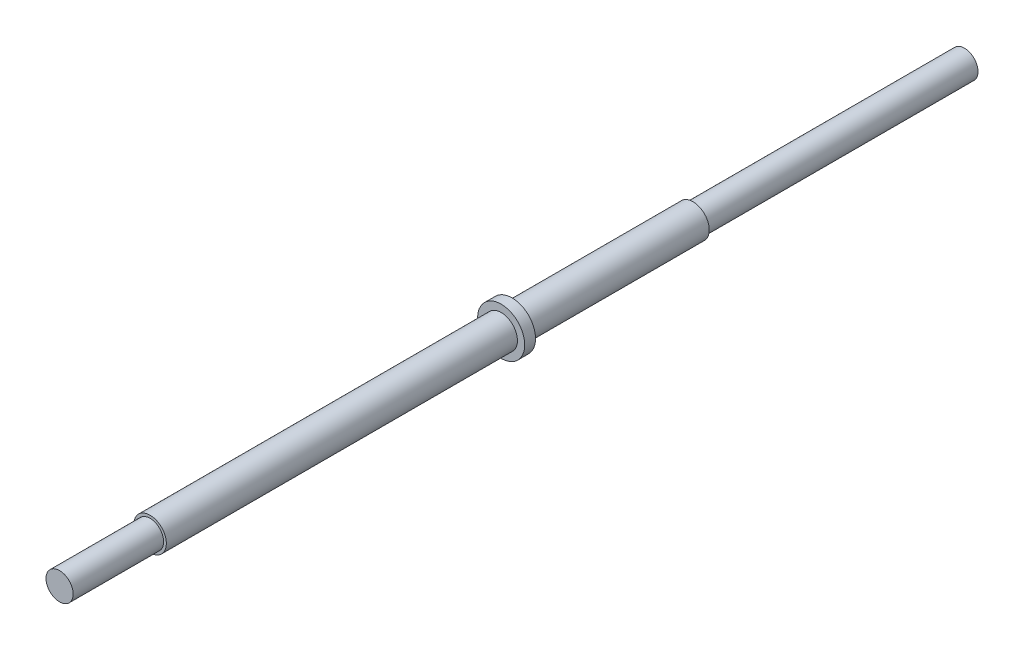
ISO-10303-21;
HEADER;
FILE_DESCRIPTION(('STEP AP214'),'2;1');
FILE_NAME('part.step','',(''),(''),'','','');
FILE_SCHEMA(('AUTOMOTIVE_DESIGN { 1 0 10303 214 1 1 1 1 }'));
ENDSEC;
DATA;
#1=APPLICATION_CONTEXT('core data for automotive mechanical design processes');
#2=APPLICATION_PROTOCOL_DEFINITION('international standard','automotive_design',2000,#1);
#3=PRODUCT_CONTEXT('',#1,'mechanical');
#4=PRODUCT('Part','Part','',(#3));
#5=PRODUCT_RELATED_PRODUCT_CATEGORY('part','',(#4));
#6=PRODUCT_DEFINITION_FORMATION('','',#4);
#7=PRODUCT_DEFINITION_CONTEXT('part definition',#1,'design');
#8=PRODUCT_DEFINITION('design','',#6,#7);
#9=PRODUCT_DEFINITION_SHAPE('','',#8);
#10=(LENGTH_UNIT() NAMED_UNIT(*) SI_UNIT(.MILLI.,.METRE.));
#11=(NAMED_UNIT(*) PLANE_ANGLE_UNIT() SI_UNIT($,.RADIAN.));
#12=(NAMED_UNIT(*) SI_UNIT($,.STERADIAN.) SOLID_ANGLE_UNIT());
#13=UNCERTAINTY_MEASURE_WITH_UNIT(LENGTH_MEASURE(1.E-05),#10,'distance_accuracy_value','');
#14=(GEOMETRIC_REPRESENTATION_CONTEXT(3) GLOBAL_UNCERTAINTY_ASSIGNED_CONTEXT((#13)) GLOBAL_UNIT_ASSIGNED_CONTEXT((#10,
#11,#12)) REPRESENTATION_CONTEXT('',''));
#15=CARTESIAN_POINT('',(0.,0.,0.));
#16=DIRECTION('',(0.,0.,1.));
#17=DIRECTION('',(1.,0.,0.));
#18=AXIS2_PLACEMENT_3D('',#15,#16,#17);
#19=CARTESIAN_POINT('',(0.,0.,0.));
#20=DIRECTION('',(0.,0.,-1.));
#21=DIRECTION('',(-1.,0.,0.));
#22=AXIS2_PLACEMENT_3D('',#19,#20,#21);
#23=CYLINDRICAL_SURFACE('',#22,4.50048818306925);
#24=CARTESIAN_POINT('',(0.,0.,125.));
#25=DIRECTION('',(0.,0.,-1.));
#26=DIRECTION('',(-1.,0.,0.));
#27=AXIS2_PLACEMENT_3D('',#24,#25,#26);
#28=CIRCLE('',#27,4.50048818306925);
#29=CARTESIAN_POINT('',(-4.50048818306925,0.,125.));
#30=VERTEX_POINT('',#29);
#31=EDGE_CURVE('E11',#30,#30,#28,.T.);
#32=ORIENTED_EDGE('',*,*,#31,.T.);
#33=EDGE_LOOP('',(#32));
#34=FACE_BOUND('',#33,.T.);
#35=CARTESIAN_POINT('',(0.,0.,128.));
#36=DIRECTION('',(0.,0.,-1.));
#37=DIRECTION('',(-1.,0.,0.));
#38=AXIS2_PLACEMENT_3D('',#35,#36,#37);
#39=CIRCLE('',#38,4.50048818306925);
#40=CARTESIAN_POINT('',(-4.50048818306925,0.,128.));
#41=VERTEX_POINT('',#40);
#42=EDGE_CURVE('E61',#41,#41,#39,.T.);
#43=ORIENTED_EDGE('',*,*,#42,.F.);
#44=EDGE_LOOP('',(#43));
#45=FACE_BOUND('',#44,.T.);
#46=ADVANCED_FACE('F47',(#34,#45),#23,.F.);
#47=CARTESIAN_POINT('',(0.,4.50048818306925,125.));
#48=DIRECTION('',(0.,0.,-1.));
#49=DIRECTION('',(-1.,0.,0.));
#50=AXIS2_PLACEMENT_3D('',#47,#48,#49);
#51=PLANE('',#50);
#52=CARTESIAN_POINT('',(0.,0.,125.));
#53=DIRECTION('',(0.,0.,-1.));
#54=DIRECTION('',(-1.,0.,0.));
#55=AXIS2_PLACEMENT_3D('',#52,#53,#54);
#56=CIRCLE('',#55,6.50048818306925);
#57=CARTESIAN_POINT('',(-6.50048818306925,0.,125.));
#58=VERTEX_POINT('',#57);
#59=EDGE_CURVE('E53',#58,#58,#56,.T.);
#60=ORIENTED_EDGE('',*,*,#59,.T.);
#61=EDGE_LOOP('',(#60));
#62=FACE_BOUND('',#61,.T.);
#63=ORIENTED_EDGE('',*,*,#31,.F.);
#64=EDGE_LOOP('',(#63));
#65=FACE_BOUND('',#64,.T.);
#66=ADVANCED_FACE('F71',(#62,#65),#51,.T.);
#67=CARTESIAN_POINT('',(0.,0.,0.));
#68=DIRECTION('',(0.,0.,-1.));
#69=DIRECTION('',(-1.,0.,0.));
#70=AXIS2_PLACEMENT_3D('',#67,#68,#69);
#71=CYLINDRICAL_SURFACE('',#70,6.50048818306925);
#72=CARTESIAN_POINT('',(0.,0.,128.));
#73=DIRECTION('',(0.,0.,-1.));
#74=DIRECTION('',(-1.,0.,0.));
#75=AXIS2_PLACEMENT_3D('',#72,#73,#74);
#76=CIRCLE('',#75,6.50048818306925);
#77=CARTESIAN_POINT('',(-6.50048818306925,0.,128.));
#78=VERTEX_POINT('',#77);
#79=EDGE_CURVE('E57',#78,#78,#76,.T.);
#80=ORIENTED_EDGE('',*,*,#79,.T.);
#81=EDGE_LOOP('',(#80));
#82=FACE_BOUND('',#81,.T.);
#83=ORIENTED_EDGE('',*,*,#59,.F.);
#84=EDGE_LOOP('',(#83));
#85=FACE_BOUND('',#84,.T.);
#86=ADVANCED_FACE('F75',(#82,#85),#71,.T.);
#87=CARTESIAN_POINT('',(0.,6.50048818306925,128.));
#88=DIRECTION('',(0.,0.,1.));
#89=DIRECTION('',(1.,0.,0.));
#90=AXIS2_PLACEMENT_3D('',#87,#88,#89);
#91=PLANE('',#90);
#92=ORIENTED_EDGE('',*,*,#42,.T.);
#93=EDGE_LOOP('',(#92));
#94=FACE_BOUND('',#93,.T.);
#95=ORIENTED_EDGE('',*,*,#79,.F.);
#96=EDGE_LOOP('',(#95));
#97=FACE_BOUND('',#96,.T.);
#98=ADVANCED_FACE('F67',(#94,#97),#91,.T.);
#99=CLOSED_SHELL('',(#46,#66,#86,#98));
#100=MANIFOLD_SOLID_BREP('B2',#99);
#101=CARTESIAN_POINT('',(0.,0.,250.));
#102=DIRECTION('',(0.,0.,-1.));
#103=DIRECTION('',(-1.,0.,0.));
#104=AXIS2_PLACEMENT_3D('',#101,#102,#103);
#105=CYLINDRICAL_SURFACE('',#104,4.5);
#106=CARTESIAN_POINT('',(0.,0.,75.));
#107=DIRECTION('',(0.,0.,-1.));
#108=DIRECTION('',(-1.,0.,0.));
#109=AXIS2_PLACEMENT_3D('',#106,#107,#108);
#110=CIRCLE('',#109,4.50000000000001);
#111=CARTESIAN_POINT('',(-4.50000000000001,0.,75.));
#112=VERTEX_POINT('',#111);
#113=EDGE_CURVE('E46',#112,#112,#110,.T.);
#114=ORIENTED_EDGE('',*,*,#113,.F.);
#115=EDGE_LOOP('',(#114));
#116=FACE_BOUND('',#115,.T.);
#117=CARTESIAN_POINT('',(0.,0.,225.));
#118=DIRECTION('',(0.,0.,-1.));
#119=DIRECTION('',(-1.,0.,0.));
#120=AXIS2_PLACEMENT_3D('',#117,#118,#119);
#121=CIRCLE('',#120,4.5);
#122=CARTESIAN_POINT('',(-4.5,0.,225.));
#123=VERTEX_POINT('',#122);
#124=EDGE_CURVE('E126',#123,#123,#121,.T.);
#125=ORIENTED_EDGE('',*,*,#124,.T.);
#126=EDGE_LOOP('',(#125));
#127=FACE_BOUND('',#126,.T.);
#128=ADVANCED_FACE('F109',(#116,#127),#105,.T.);
#129=CARTESIAN_POINT('',(4.50000000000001,0.,75.));
#130=DIRECTION('',(0.,0.,-1.));
#131=DIRECTION('',(-1.,0.,0.));
#132=AXIS2_PLACEMENT_3D('',#129,#130,#131);
#133=PLANE('',#132);
#134=ORIENTED_EDGE('',*,*,#113,.T.);
#135=EDGE_LOOP('',(#134));
#136=FACE_BOUND('',#135,.T.);
#137=CARTESIAN_POINT('',(0.,0.,75.));
#138=DIRECTION('',(0.,0.,-1.));
#139=DIRECTION('',(-1.,0.,0.));
#140=AXIS2_PLACEMENT_3D('',#137,#138,#139);
#141=CIRCLE('',#140,3.75);
#142=CARTESIAN_POINT('',(-3.75,0.,75.));
#143=VERTEX_POINT('',#142);
#144=EDGE_CURVE('E116',#143,#143,#141,.T.);
#145=ORIENTED_EDGE('',*,*,#144,.F.);
#146=EDGE_LOOP('',(#145));
#147=FACE_BOUND('',#146,.T.);
#148=ADVANCED_FACE('F154',(#136,#147),#133,.T.);
#149=CARTESIAN_POINT('',(0.,0.,0.));
#150=DIRECTION('',(0.,0.,-1.));
#151=DIRECTION('',(-1.,0.,0.));
#152=AXIS2_PLACEMENT_3D('',#149,#150,#151);
#153=CYLINDRICAL_SURFACE('',#152,3.75);
#154=ORIENTED_EDGE('',*,*,#144,.T.);
#155=EDGE_LOOP('',(#154));
#156=FACE_BOUND('',#155,.T.);
#157=CARTESIAN_POINT('',(0.,0.,0.));
#158=DIRECTION('',(0.,0.,-1.));
#159=DIRECTION('',(-1.,0.,0.));
#160=AXIS2_PLACEMENT_3D('',#157,#158,#159);
#161=CIRCLE('',#160,3.75);
#162=CARTESIAN_POINT('',(-3.75,0.,0.));
#163=VERTEX_POINT('',#162);
#164=EDGE_CURVE('E121',#163,#163,#161,.T.);
#165=ORIENTED_EDGE('',*,*,#164,.F.);
#166=EDGE_LOOP('',(#165));
#167=FACE_BOUND('',#166,.T.);
#168=ADVANCED_FACE('F159',(#156,#167),#153,.T.);
#169=CARTESIAN_POINT('',(0.,0.,0.));
#170=DIRECTION('',(0.,0.,1.));
#171=DIRECTION('',(1.,0.,0.));
#172=AXIS2_PLACEMENT_3D('',#169,#170,#171);
#173=PLANE('',#172);
#174=ORIENTED_EDGE('',*,*,#164,.T.);
#175=EDGE_LOOP('',(#174));
#176=FACE_BOUND('',#175,.T.);
#177=ADVANCED_FACE('F164',(#176),#173,.F.);
#178=CARTESIAN_POINT('',(4.5,0.,225.));
#179=DIRECTION('',(0.,0.,1.));
#180=DIRECTION('',(1.,0.,0.));
#181=AXIS2_PLACEMENT_3D('',#178,#179,#180);
#182=PLANE('',#181);
#183=CARTESIAN_POINT('',(0.,0.,225.));
#184=DIRECTION('',(0.,0.,-1.));
#185=DIRECTION('',(-1.,0.,0.));
#186=AXIS2_PLACEMENT_3D('',#183,#184,#185);
#187=CIRCLE('',#186,3.75);
#188=CARTESIAN_POINT('',(-3.75,0.,225.));
#189=VERTEX_POINT('',#188);
#190=EDGE_CURVE('E132',#189,#189,#187,.T.);
#191=ORIENTED_EDGE('',*,*,#190,.T.);
#192=EDGE_LOOP('',(#191));
#193=FACE_BOUND('',#192,.T.);
#194=ORIENTED_EDGE('',*,*,#124,.F.);
#195=EDGE_LOOP('',(#194));
#196=FACE_BOUND('',#195,.T.);
#197=ADVANCED_FACE('F150',(#193,#196),#182,.T.);
#198=CARTESIAN_POINT('',(0.,0.,0.));
#199=DIRECTION('',(0.,0.,-1.));
#200=DIRECTION('',(-1.,0.,0.));
#201=AXIS2_PLACEMENT_3D('',#198,#199,#200);
#202=CYLINDRICAL_SURFACE('',#201,3.75);
#203=CARTESIAN_POINT('',(0.,0.,250.));
#204=DIRECTION('',(0.,0.,-1.));
#205=DIRECTION('',(-1.,0.,0.));
#206=AXIS2_PLACEMENT_3D('',#203,#204,#205);
#207=CIRCLE('',#206,3.75);
#208=CARTESIAN_POINT('',(-3.75,0.,250.));
#209=VERTEX_POINT('',#208);
#210=EDGE_CURVE('E136',#209,#209,#207,.T.);
#211=ORIENTED_EDGE('',*,*,#210,.T.);
#212=EDGE_LOOP('',(#211));
#213=FACE_BOUND('',#212,.T.);
#214=ORIENTED_EDGE('',*,*,#190,.F.);
#215=EDGE_LOOP('',(#214));
#216=FACE_BOUND('',#215,.T.);
#217=ADVANCED_FACE('F141',(#213,#216),#202,.T.);
#218=CARTESIAN_POINT('',(0.,0.,250.));
#219=DIRECTION('',(0.,0.,1.));
#220=DIRECTION('',(1.,0.,0.));
#221=AXIS2_PLACEMENT_3D('',#218,#219,#220);
#222=PLANE('',#221);
#223=ORIENTED_EDGE('',*,*,#210,.F.);
#224=EDGE_LOOP('',(#223));
#225=FACE_BOUND('',#224,.T.);
#226=ADVANCED_FACE('F144',(#225),#222,.T.);
#227=CLOSED_SHELL('',(#128,#148,#168,#177,#197,#217,#226));
#228=MANIFOLD_SOLID_BREP('B6',#227);
#229=ADVANCED_BREP_SHAPE_REPRESENTATION('',(#18,#100,#228),#14);
#230=SHAPE_DEFINITION_REPRESENTATION(#9,#229);
ENDSEC;
END-ISO-10303-21;
